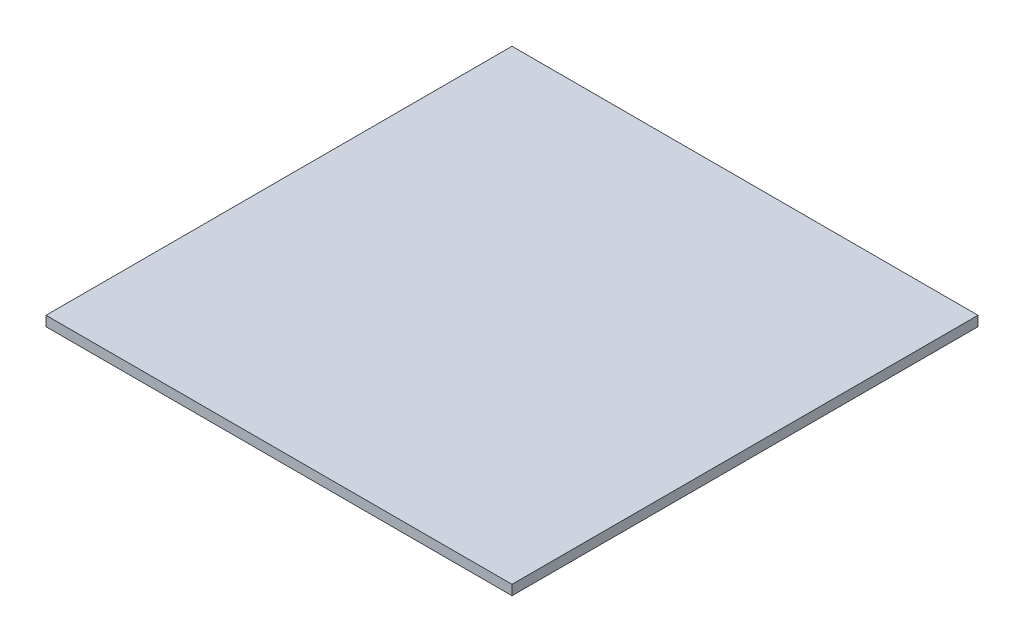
ISO-10303-21;
HEADER;
FILE_DESCRIPTION(('STEP AP214'),'2;1');
FILE_NAME('part.step','',(''),(''),'','','');
FILE_SCHEMA(('AUTOMOTIVE_DESIGN { 1 0 10303 214 1 1 1 1 }'));
ENDSEC;
DATA;
#1=APPLICATION_CONTEXT('core data for automotive mechanical design processes');
#2=APPLICATION_PROTOCOL_DEFINITION('international standard','automotive_design',2000,#1);
#3=PRODUCT_CONTEXT('',#1,'mechanical');
#4=PRODUCT('Part','Part','',(#3));
#5=PRODUCT_RELATED_PRODUCT_CATEGORY('part','',(#4));
#6=PRODUCT_DEFINITION_FORMATION('','',#4);
#7=PRODUCT_DEFINITION_CONTEXT('part definition',#1,'design');
#8=PRODUCT_DEFINITION('design','',#6,#7);
#9=PRODUCT_DEFINITION_SHAPE('','',#8);
#10=(LENGTH_UNIT() NAMED_UNIT(*) SI_UNIT(.MILLI.,.METRE.));
#11=(NAMED_UNIT(*) PLANE_ANGLE_UNIT() SI_UNIT($,.RADIAN.));
#12=(NAMED_UNIT(*) SI_UNIT($,.STERADIAN.) SOLID_ANGLE_UNIT());
#13=UNCERTAINTY_MEASURE_WITH_UNIT(LENGTH_MEASURE(1.E-05),#10,'distance_accuracy_value','');
#14=(GEOMETRIC_REPRESENTATION_CONTEXT(3) GLOBAL_UNCERTAINTY_ASSIGNED_CONTEXT((#13)) GLOBAL_UNIT_ASSIGNED_CONTEXT((#10,
#11,#12)) REPRESENTATION_CONTEXT('',''));
#15=CARTESIAN_POINT('',(0.,0.,0.));
#16=DIRECTION('',(0.,0.,1.));
#17=DIRECTION('',(1.,0.,0.));
#18=AXIS2_PLACEMENT_3D('',#15,#16,#17);
#19=CARTESIAN_POINT('',(0.,10.,0.));
#20=DIRECTION('',(1.,0.,0.));
#21=DIRECTION('',(0.,0.,-1.));
#22=AXIS2_PLACEMENT_3D('',#19,#20,#21);
#23=PLANE('',#22);
#24=DIRECTION('',(0.,0.,1.));
#25=VECTOR('',#24,1.);
#26=CARTESIAN_POINT('',(0.,0.,0.));
#27=LINE('',#26,#25);
#28=CARTESIAN_POINT('',(0.,0.,-470.));
#29=VERTEX_POINT('',#28);
#30=CARTESIAN_POINT('',(0.,0.,0.));
#31=VERTEX_POINT('',#30);
#32=EDGE_CURVE('E105',#29,#31,#27,.T.);
#33=ORIENTED_EDGE('',*,*,#32,.T.);
#34=DIRECTION('',(0.,-1.,0.));
#35=VECTOR('',#34,1.);
#36=CARTESIAN_POINT('',(0.,10.,0.));
#37=LINE('',#36,#35);
#38=CARTESIAN_POINT('',(0.,10.,0.));
#39=VERTEX_POINT('',#38);
#40=EDGE_CURVE('E11',#39,#31,#37,.T.);
#41=ORIENTED_EDGE('',*,*,#40,.F.);
#42=DIRECTION('',(0.,0.,1.));
#43=VECTOR('',#42,1.);
#44=CARTESIAN_POINT('',(0.,10.,0.));
#45=LINE('',#44,#43);
#46=CARTESIAN_POINT('',(0.,10.,-470.));
#47=VERTEX_POINT('',#46);
#48=EDGE_CURVE('E93',#47,#39,#45,.T.);
#49=ORIENTED_EDGE('',*,*,#48,.F.);
#50=DIRECTION('',(0.,-1.,0.));
#51=VECTOR('',#50,1.);
#52=CARTESIAN_POINT('',(0.,10.,-470.));
#53=LINE('',#52,#51);
#54=EDGE_CURVE('E101',#47,#29,#53,.T.);
#55=ORIENTED_EDGE('',*,*,#54,.T.);
#56=EDGE_LOOP('',(#33,#41,#49,#55));
#57=FACE_BOUND('',#56,.T.);
#58=ADVANCED_FACE('F42',(#57),#23,.F.);
#59=CARTESIAN_POINT('',(0.,10.,0.));
#60=DIRECTION('',(0.,0.,-1.));
#61=DIRECTION('',(-1.,0.,0.));
#62=AXIS2_PLACEMENT_3D('',#59,#60,#61);
#63=PLANE('',#62);
#64=DIRECTION('',(1.,0.,0.));
#65=VECTOR('',#64,1.);
#66=CARTESIAN_POINT('',(0.,0.,0.));
#67=LINE('',#66,#65);
#68=CARTESIAN_POINT('',(470.,0.,0.));
#69=VERTEX_POINT('',#68);
#70=EDGE_CURVE('E97',#31,#69,#67,.T.);
#71=ORIENTED_EDGE('',*,*,#70,.T.);
#72=DIRECTION('',(0.,-1.,0.));
#73=VECTOR('',#72,1.);
#74=CARTESIAN_POINT('',(470.,10.,0.));
#75=LINE('',#74,#73);
#76=CARTESIAN_POINT('',(470.,10.,0.));
#77=VERTEX_POINT('',#76);
#78=EDGE_CURVE('E50',#77,#69,#75,.T.);
#79=ORIENTED_EDGE('',*,*,#78,.F.);
#80=DIRECTION('',(1.,0.,0.));
#81=VECTOR('',#80,1.);
#82=CARTESIAN_POINT('',(0.,10.,0.));
#83=LINE('',#82,#81);
#84=EDGE_CURVE('E88',#39,#77,#83,.T.);
#85=ORIENTED_EDGE('',*,*,#84,.F.);
#86=ORIENTED_EDGE('',*,*,#40,.T.);
#87=EDGE_LOOP('',(#71,#79,#85,#86));
#88=FACE_BOUND('',#87,.T.);
#89=ADVANCED_FACE('F96',(#88),#63,.F.);
#90=CARTESIAN_POINT('',(470.,10.,0.));
#91=DIRECTION('',(-1.,0.,0.));
#92=DIRECTION('',(0.,0.,1.));
#93=AXIS2_PLACEMENT_3D('',#90,#91,#92);
#94=PLANE('',#93);
#95=DIRECTION('',(0.,0.,-1.));
#96=VECTOR('',#95,1.);
#97=CARTESIAN_POINT('',(470.,0.,0.));
#98=LINE('',#97,#96);
#99=CARTESIAN_POINT('',(470.,0.,-470.));
#100=VERTEX_POINT('',#99);
#101=EDGE_CURVE('E75',#69,#100,#98,.T.);
#102=ORIENTED_EDGE('',*,*,#101,.T.);
#103=DIRECTION('',(0.,-1.,0.));
#104=VECTOR('',#103,1.);
#105=CARTESIAN_POINT('',(470.,10.,-470.));
#106=LINE('',#105,#104);
#107=CARTESIAN_POINT('',(470.,10.,-470.));
#108=VERTEX_POINT('',#107);
#109=EDGE_CURVE('E98',#108,#100,#106,.T.);
#110=ORIENTED_EDGE('',*,*,#109,.F.);
#111=DIRECTION('',(0.,0.,-1.));
#112=VECTOR('',#111,1.);
#113=CARTESIAN_POINT('',(470.,10.,0.));
#114=LINE('',#113,#112);
#115=EDGE_CURVE('E91',#77,#108,#114,.T.);
#116=ORIENTED_EDGE('',*,*,#115,.F.);
#117=ORIENTED_EDGE('',*,*,#78,.T.);
#118=EDGE_LOOP('',(#102,#110,#116,#117));
#119=FACE_BOUND('',#118,.T.);
#120=ADVANCED_FACE('F99',(#119),#94,.F.);
#121=CARTESIAN_POINT('',(0.,10.,-470.));
#122=DIRECTION('',(0.,0.,1.));
#123=DIRECTION('',(1.,0.,0.));
#124=AXIS2_PLACEMENT_3D('',#121,#122,#123);
#125=PLANE('',#124);
#126=DIRECTION('',(-1.,0.,0.));
#127=VECTOR('',#126,1.);
#128=CARTESIAN_POINT('',(0.,0.,-470.));
#129=LINE('',#128,#127);
#130=EDGE_CURVE('E81',#100,#29,#129,.T.);
#131=ORIENTED_EDGE('',*,*,#130,.T.);
#132=ORIENTED_EDGE('',*,*,#54,.F.);
#133=DIRECTION('',(-1.,0.,0.));
#134=VECTOR('',#133,1.);
#135=CARTESIAN_POINT('',(0.,10.,-470.));
#136=LINE('',#135,#134);
#137=EDGE_CURVE('E58',#108,#47,#136,.T.);
#138=ORIENTED_EDGE('',*,*,#137,.F.);
#139=ORIENTED_EDGE('',*,*,#109,.T.);
#140=EDGE_LOOP('',(#131,#132,#138,#139));
#141=FACE_BOUND('',#140,.T.);
#142=ADVANCED_FACE('F112',(#141),#125,.F.);
#143=CARTESIAN_POINT('',(0.,10.,0.));
#144=DIRECTION('',(0.,-1.,0.));
#145=DIRECTION('',(0.,0.,-1.));
#146=AXIS2_PLACEMENT_3D('',#143,#144,#145);
#147=PLANE('',#146);
#148=ORIENTED_EDGE('',*,*,#48,.T.);
#149=ORIENTED_EDGE('',*,*,#84,.T.);
#150=ORIENTED_EDGE('',*,*,#115,.T.);
#151=ORIENTED_EDGE('',*,*,#137,.T.);
#152=EDGE_LOOP('',(#148,#149,#150,#151));
#153=FACE_BOUND('',#152,.T.);
#154=ADVANCED_FACE('F89',(#153),#147,.F.);
#155=CARTESIAN_POINT('',(0.,0.,0.));
#156=DIRECTION('',(0.,-1.,0.));
#157=DIRECTION('',(0.,0.,-1.));
#158=AXIS2_PLACEMENT_3D('',#155,#156,#157);
#159=PLANE('',#158);
#160=ORIENTED_EDGE('',*,*,#32,.F.);
#161=ORIENTED_EDGE('',*,*,#130,.F.);
#162=ORIENTED_EDGE('',*,*,#101,.F.);
#163=ORIENTED_EDGE('',*,*,#70,.F.);
#164=EDGE_LOOP('',(#160,#161,#162,#163));
#165=FACE_BOUND('',#164,.T.);
#166=ADVANCED_FACE('F115',(#165),#159,.T.);
#167=CLOSED_SHELL('',(#58,#89,#120,#142,#154,#166));
#168=MANIFOLD_SOLID_BREP('B2',#167);
#169=ADVANCED_BREP_SHAPE_REPRESENTATION('',(#18,#168),#14);
#170=SHAPE_DEFINITION_REPRESENTATION(#9,#169);
ENDSEC;
END-ISO-10303-21;
